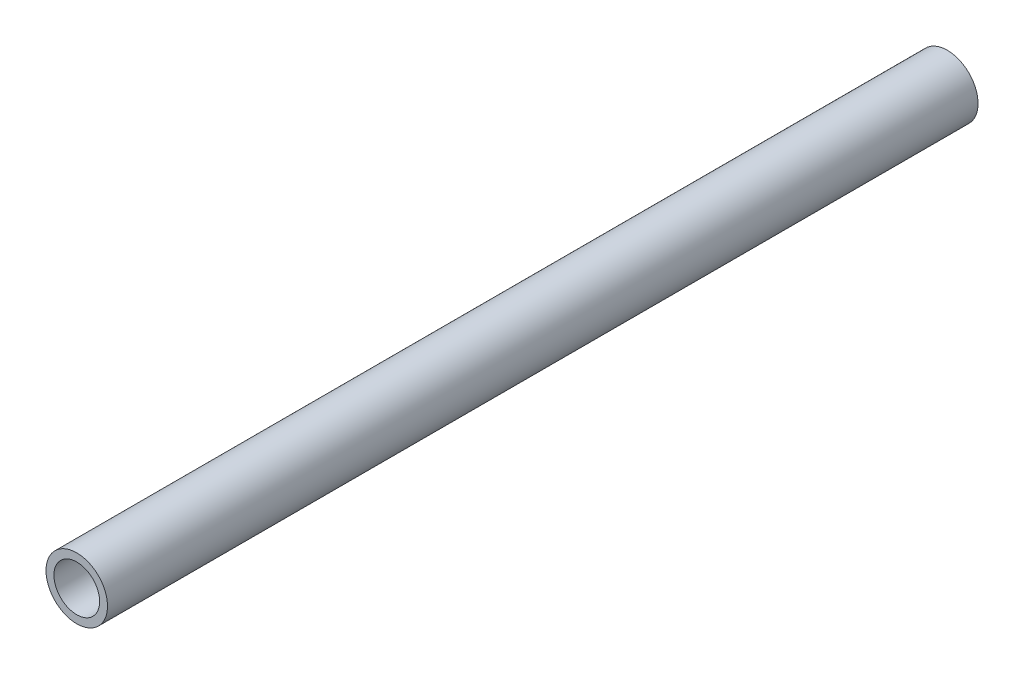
from build123d import *

# Parameters (mm, degrees)
SKETCH1_R           = 10.7696
SKETCH1_R_2         = 8.001
BOSS_EXTRUDE1_DEPTH = 152.4


with BuildPart() as part:
    # Sketch1 → Boss-Extrude1 (new, symmetric)
    with BuildSketch(Plane.XY):
        with Locations(Location((0, 0, 0), (0, 0, 180))):
            Circle(SKETCH1_R)
        with Locations(Location((0, 0, 0), (0, 0, 180))):
            Circle(SKETCH1_R_2, mode=Mode.SUBTRACT)
    extrude(amount=BOSS_EXTRUDE1_DEPTH, both=True)


solid = part.part
